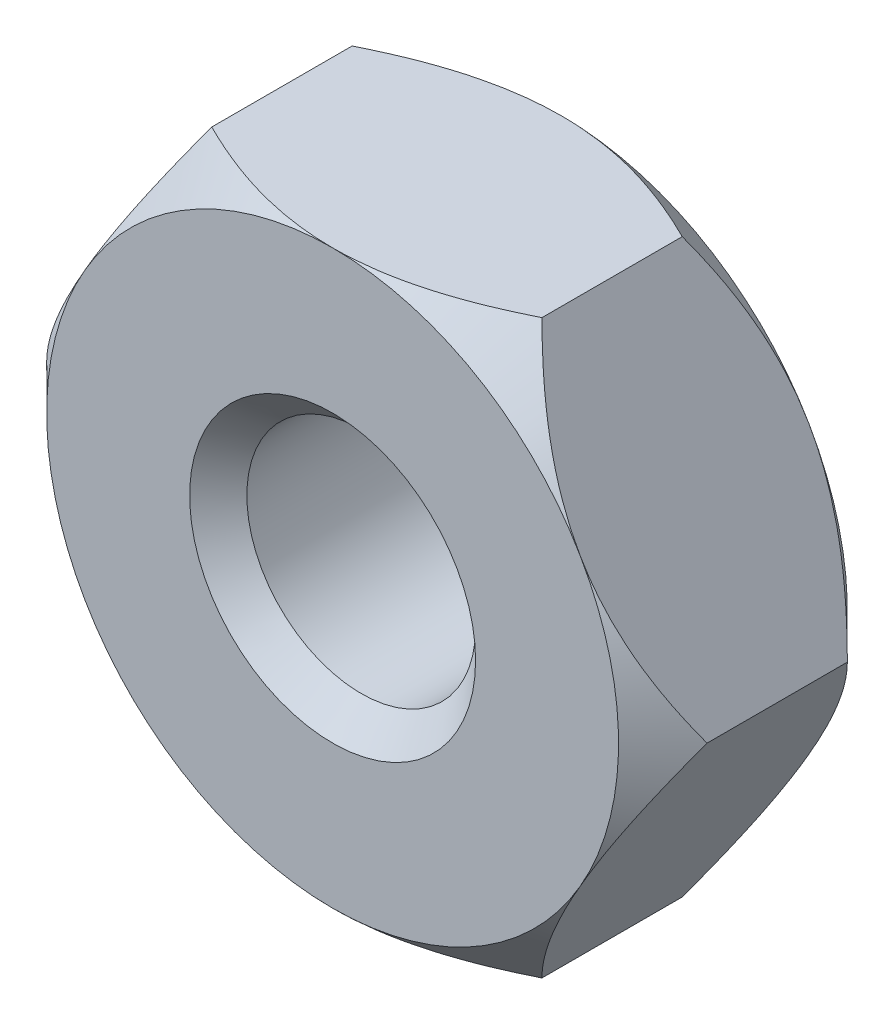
from build123d import *

# Parameters (mm, degrees)
AUFSATZ_LINEAR_AUSTRAGEN1_DEPTH = 0.8
SKIZZE2_OUTSIDE_W               = 16.778
SKIZZE2_OUTSIDE_H               = 16.16
SKIZZE2_OUTSIDE_R               = 2
SCHNITT_LINEAR_AUSTRAGEN1_DEPTH = 4.448671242
SCHNITT_LINEAR_AUSTRAGEN1_DRAFT = -45
SPIEGELN1_COPY_1_SKETCH_W       = 16.778
SPIEGELN1_COPY_1_SKETCH_H       = 16.16
SPIEGELN1_COPY_1_SKETCH_R       = 2
SPIEGELN1_COPY_1_DEPTH          = 4.448671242
SPIEGELN1_COPY_1_DRAFT          = -45
GEWINDEBOHRUNG1_D               = 1.6
FASE1_SIZE                      = 0.2


with BuildPart() as part:
    # Skizze1 → Aufsatz-Linear austragen1 (new, symmetric)
    with BuildSketch(Plane.XY):
        Polygon((2.309401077, 0), (1.154700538, 2), (-1.154700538, 2), (-2.309401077, 0), (-1.154700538, -2), (1.154700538, -2), align=None)
    extrude(amount=AUFSATZ_LINEAR_AUSTRAGEN1_DEPTH, both=True)


with BuildPart() as schnitt_linear_austragen1_tool:
    # Skizze2 outside → Schnitt-Linear austragen1 (with draft: the straight prism first)
    with BuildSketch(Plane.XY.offset(0.8)):
        Rectangle(SKIZZE2_OUTSIDE_W, SKIZZE2_OUTSIDE_H)
        Circle(SKIZZE2_OUTSIDE_R, mode=Mode.SUBTRACT)
    extrude(amount=-SCHNITT_LINEAR_AUSTRAGEN1_DEPTH)
    # Schnitt-Linear austragen1: the draft: its side faces are tilted about the plane it starts from
    schnitt_linear_austragen1_sides = [schnitt_linear_austragen1_tool.faces().sort_by_distance(p)[0] for p in [
        (0, -8.08, -1.424335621),
        (8.389, 0, -1.424335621),
        (0, 8.08, -1.424335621),
        (-8.389, 0, -1.424335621),
        (-2, 0, -1.424335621),
    ]]
    draft(schnitt_linear_austragen1_sides, Plane.XY.offset(0.8), SCHNITT_LINEAR_AUSTRAGEN1_DRAFT)


with BuildPart() as part_1:
    add(part.part)

    # Schnitt-Linear austragen1: cut by schnitt_linear_austragen1_tool
    add(schnitt_linear_austragen1_tool.part, mode=Mode.SUBTRACT)


with BuildPart() as spiegeln1_copy_1_tool:
    # Spiegeln1 copy 1 sketch → Spiegeln1 copy 1 (with draft: the straight prism first)
    with BuildSketch(Plane(origin=(0, 0, -0.8), x_dir=(1, 0, 0), z_dir=(0, 0, -1))):
        Rectangle(SPIEGELN1_COPY_1_SKETCH_W, SPIEGELN1_COPY_1_SKETCH_H)
        Circle(SPIEGELN1_COPY_1_SKETCH_R, mode=Mode.SUBTRACT)
    extrude(amount=-SPIEGELN1_COPY_1_DEPTH)
    # Spiegeln1 copy 1: the draft: its side faces are tilted about the plane it starts from
    spiegeln1_copy_1_sides = [spiegeln1_copy_1_tool.faces().sort_by_distance(p)[0] for p in [
        (0, -8.08, 1.424335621),
        (8.389, 0, 1.424335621),
        (0, 8.08, 1.424335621),
        (-8.389, 0, 1.424335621),
        (-2, 0, 1.424335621),
    ]]
    draft(spiegeln1_copy_1_sides, Plane(origin=(0, 0, -0.8), x_dir=(1, 0, 0), z_dir=(0, 0, -1)), SPIEGELN1_COPY_1_DRAFT)


with BuildPart() as part_2:
    add(part_1.part)

    # Spiegeln1 copy 1: cut by spiegeln1_copy_1_tool
    add(spiegeln1_copy_1_tool.part, mode=Mode.SUBTRACT)

    # Gewindebohrung1 (through all)
    with Locations(Plane.XY.offset(0.8)):
        with Locations((0, 0)):
            Hole(GEWINDEBOHRUNG1_D / 2)

    # Fase1
    fase1_edges = [part_2.edges().sort_by_distance(p)[0] for p in [
        (0.8, 0, 0.8),
        (0.8, 0, -0.8),
    ]]
    chamfer(fase1_edges, length=FASE1_SIZE)


solid = part_2.part
